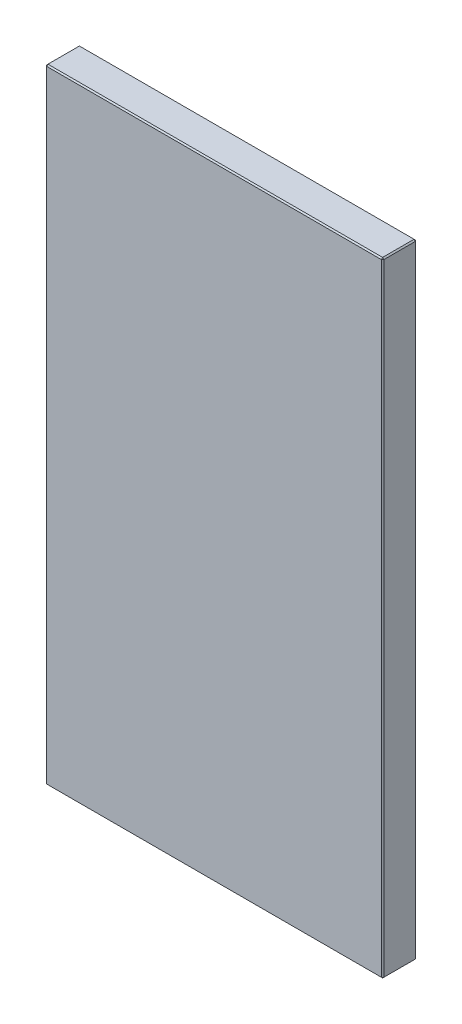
ISO-10303-21;
HEADER;
FILE_DESCRIPTION(('STEP AP214'),'2;1');
FILE_NAME('part.step','',(''),(''),'','','');
FILE_SCHEMA(('AUTOMOTIVE_DESIGN { 1 0 10303 214 1 1 1 1 }'));
ENDSEC;
DATA;
#1=APPLICATION_CONTEXT('core data for automotive mechanical design processes');
#2=APPLICATION_PROTOCOL_DEFINITION('international standard','automotive_design',2000,#1);
#3=PRODUCT_CONTEXT('',#1,'mechanical');
#4=PRODUCT('Part','Part','',(#3));
#5=PRODUCT_RELATED_PRODUCT_CATEGORY('part','',(#4));
#6=PRODUCT_DEFINITION_FORMATION('','',#4);
#7=PRODUCT_DEFINITION_CONTEXT('part definition',#1,'design');
#8=PRODUCT_DEFINITION('design','',#6,#7);
#9=PRODUCT_DEFINITION_SHAPE('','',#8);
#10=(LENGTH_UNIT() NAMED_UNIT(*) SI_UNIT(.MILLI.,.METRE.));
#11=(NAMED_UNIT(*) PLANE_ANGLE_UNIT() SI_UNIT($,.RADIAN.));
#12=(NAMED_UNIT(*) SI_UNIT($,.STERADIAN.) SOLID_ANGLE_UNIT());
#13=UNCERTAINTY_MEASURE_WITH_UNIT(LENGTH_MEASURE(1.E-05),#10,'distance_accuracy_value','');
#14=(GEOMETRIC_REPRESENTATION_CONTEXT(3) GLOBAL_UNCERTAINTY_ASSIGNED_CONTEXT((#13)) GLOBAL_UNIT_ASSIGNED_CONTEXT((#10,
#11,#12)) REPRESENTATION_CONTEXT('',''));
#15=CARTESIAN_POINT('',(0.,0.,0.));
#16=DIRECTION('',(0.,0.,1.));
#17=DIRECTION('',(1.,0.,0.));
#18=AXIS2_PLACEMENT_3D('',#15,#16,#17);
#19=CARTESIAN_POINT('',(-134.,-248.,27.));
#20=DIRECTION('',(1.,0.,0.));
#21=DIRECTION('',(0.,0.,-1.));
#22=AXIS2_PLACEMENT_3D('',#19,#20,#21);
#23=PLANE('',#22);
#24=DIRECTION('',(0.,0.,-1.));
#25=VECTOR('',#24,1.);
#26=CARTESIAN_POINT('',(-134.,247.,27.));
#27=LINE('',#26,#25);
#28=CARTESIAN_POINT('',(-134.,247.,26.));
#29=VERTEX_POINT('',#28);
#30=CARTESIAN_POINT('',(-134.,247.,1.));
#31=VERTEX_POINT('',#30);
#32=EDGE_CURVE('E114',#29,#31,#27,.T.);
#33=ORIENTED_EDGE('',*,*,#32,.T.);
#34=DIRECTION('',(0.,-1.,0.));
#35=VECTOR('',#34,1.);
#36=CARTESIAN_POINT('',(-134.,-248.,1.));
#37=LINE('',#36,#35);
#38=CARTESIAN_POINT('',(-134.,-247.,1.));
#39=VERTEX_POINT('',#38);
#40=EDGE_CURVE('E110',#31,#39,#37,.T.);
#41=ORIENTED_EDGE('',*,*,#40,.T.);
#42=DIRECTION('',(0.,0.,1.));
#43=VECTOR('',#42,1.);
#44=CARTESIAN_POINT('',(-134.,-247.,27.));
#45=LINE('',#44,#43);
#46=CARTESIAN_POINT('',(-134.,-247.,26.));
#47=VERTEX_POINT('',#46);
#48=EDGE_CURVE('E103',#39,#47,#45,.T.);
#49=ORIENTED_EDGE('',*,*,#48,.T.);
#50=DIRECTION('',(0.,1.,0.));
#51=VECTOR('',#50,1.);
#52=CARTESIAN_POINT('',(-134.,248.,26.));
#53=LINE('',#52,#51);
#54=EDGE_CURVE('E107',#47,#29,#53,.T.);
#55=ORIENTED_EDGE('',*,*,#54,.T.);
#56=EDGE_LOOP('',(#33,#41,#49,#55));
#57=FACE_BOUND('',#56,.T.);
#58=ADVANCED_FACE('F15',(#57),#23,.F.);
#59=CARTESIAN_POINT('',(134.,-248.,27.));
#60=DIRECTION('',(0.,1.,0.));
#61=DIRECTION('',(-1.,0.,0.));
#62=AXIS2_PLACEMENT_3D('',#59,#60,#61);
#63=PLANE('',#62);
#64=DIRECTION('',(0.,0.,-1.));
#65=VECTOR('',#64,1.);
#66=CARTESIAN_POINT('',(-133.,-248.,27.));
#67=LINE('',#66,#65);
#68=CARTESIAN_POINT('',(-133.,-248.,26.));
#69=VERTEX_POINT('',#68);
#70=CARTESIAN_POINT('',(-133.,-248.,1.));
#71=VERTEX_POINT('',#70);
#72=EDGE_CURVE('E122',#69,#71,#67,.T.);
#73=ORIENTED_EDGE('',*,*,#72,.T.);
#74=DIRECTION('',(1.,0.,0.));
#75=VECTOR('',#74,1.);
#76=CARTESIAN_POINT('',(134.,-248.,1.));
#77=LINE('',#76,#75);
#78=CARTESIAN_POINT('',(133.,-248.,1.));
#79=VERTEX_POINT('',#78);
#80=EDGE_CURVE('E160',#71,#79,#77,.T.);
#81=ORIENTED_EDGE('',*,*,#80,.T.);
#82=DIRECTION('',(0.,0.,1.));
#83=VECTOR('',#82,1.);
#84=CARTESIAN_POINT('',(133.,-248.,27.));
#85=LINE('',#84,#83);
#86=CARTESIAN_POINT('',(133.,-248.,26.));
#87=VERTEX_POINT('',#86);
#88=EDGE_CURVE('E157',#79,#87,#85,.T.);
#89=ORIENTED_EDGE('',*,*,#88,.T.);
#90=DIRECTION('',(-1.,0.,0.));
#91=VECTOR('',#90,1.);
#92=CARTESIAN_POINT('',(-134.,-248.,26.));
#93=LINE('',#92,#91);
#94=EDGE_CURVE('E155',#87,#69,#93,.T.);
#95=ORIENTED_EDGE('',*,*,#94,.T.);
#96=EDGE_LOOP('',(#73,#81,#89,#95));
#97=FACE_BOUND('',#96,.T.);
#98=ADVANCED_FACE('F277',(#97),#63,.F.);
#99=CARTESIAN_POINT('',(134.,-248.,27.));
#100=DIRECTION('',(-1.,0.,0.));
#101=DIRECTION('',(0.,0.,1.));
#102=AXIS2_PLACEMENT_3D('',#99,#100,#101);
#103=PLANE('',#102);
#104=DIRECTION('',(0.,-1.,0.));
#105=VECTOR('',#104,1.);
#106=CARTESIAN_POINT('',(134.,-248.,26.));
#107=LINE('',#106,#105);
#108=CARTESIAN_POINT('',(134.,247.,26.));
#109=VERTEX_POINT('',#108);
#110=CARTESIAN_POINT('',(134.,-247.,26.));
#111=VERTEX_POINT('',#110);
#112=EDGE_CURVE('E162',#109,#111,#107,.T.);
#113=ORIENTED_EDGE('',*,*,#112,.T.);
#114=DIRECTION('',(0.,0.,-1.));
#115=VECTOR('',#114,1.);
#116=CARTESIAN_POINT('',(134.,-247.,27.));
#117=LINE('',#116,#115);
#118=CARTESIAN_POINT('',(134.,-247.,1.));
#119=VERTEX_POINT('',#118);
#120=EDGE_CURVE('E168',#111,#119,#117,.T.);
#121=ORIENTED_EDGE('',*,*,#120,.T.);
#122=DIRECTION('',(0.,1.,0.));
#123=VECTOR('',#122,1.);
#124=CARTESIAN_POINT('',(134.,-248.,1.));
#125=LINE('',#124,#123);
#126=CARTESIAN_POINT('',(134.,247.,1.));
#127=VERTEX_POINT('',#126);
#128=EDGE_CURVE('E166',#119,#127,#125,.T.);
#129=ORIENTED_EDGE('',*,*,#128,.T.);
#130=DIRECTION('',(0.,0.,1.));
#131=VECTOR('',#130,1.);
#132=CARTESIAN_POINT('',(134.,247.,27.));
#133=LINE('',#132,#131);
#134=EDGE_CURVE('E164',#127,#109,#133,.T.);
#135=ORIENTED_EDGE('',*,*,#134,.T.);
#136=EDGE_LOOP('',(#113,#121,#129,#135));
#137=FACE_BOUND('',#136,.T.);
#138=ADVANCED_FACE('F254',(#137),#103,.F.);
#139=CARTESIAN_POINT('',(134.,248.,27.));
#140=DIRECTION('',(0.,-1.,0.));
#141=DIRECTION('',(1.,0.,0.));
#142=AXIS2_PLACEMENT_3D('',#139,#140,#141);
#143=PLANE('',#142);
#144=DIRECTION('',(-1.,0.,0.));
#145=VECTOR('',#144,1.);
#146=CARTESIAN_POINT('',(134.,248.,1.));
#147=LINE('',#146,#145);
#148=CARTESIAN_POINT('',(133.,248.,1.));
#149=VERTEX_POINT('',#148);
#150=CARTESIAN_POINT('',(-133.,248.,1.));
#151=VERTEX_POINT('',#150);
#152=EDGE_CURVE('E150',#149,#151,#147,.T.);
#153=ORIENTED_EDGE('',*,*,#152,.T.);
#154=DIRECTION('',(0.,0.,1.));
#155=VECTOR('',#154,1.);
#156=CARTESIAN_POINT('',(-133.,248.,27.));
#157=LINE('',#156,#155);
#158=CARTESIAN_POINT('',(-133.,248.,26.));
#159=VERTEX_POINT('',#158);
#160=EDGE_CURVE('E152',#151,#159,#157,.T.);
#161=ORIENTED_EDGE('',*,*,#160,.T.);
#162=DIRECTION('',(1.,0.,0.));
#163=VECTOR('',#162,1.);
#164=CARTESIAN_POINT('',(134.,248.,26.));
#165=LINE('',#164,#163);
#166=CARTESIAN_POINT('',(133.,248.,26.));
#167=VERTEX_POINT('',#166);
#168=EDGE_CURVE('E146',#159,#167,#165,.T.);
#169=ORIENTED_EDGE('',*,*,#168,.T.);
#170=DIRECTION('',(0.,0.,-1.));
#171=VECTOR('',#170,1.);
#172=CARTESIAN_POINT('',(133.,248.,27.));
#173=LINE('',#172,#171);
#174=EDGE_CURVE('E148',#167,#149,#173,.T.);
#175=ORIENTED_EDGE('',*,*,#174,.T.);
#176=EDGE_LOOP('',(#153,#161,#169,#175));
#177=FACE_BOUND('',#176,.T.);
#178=ADVANCED_FACE('F286',(#177),#143,.F.);
#179=CARTESIAN_POINT('',(0.,0.,27.));
#180=DIRECTION('',(0.,0.,1.));
#181=DIRECTION('',(1.,0.,0.));
#182=AXIS2_PLACEMENT_3D('',#179,#180,#181);
#183=PLANE('',#182);
#184=DIRECTION('',(0.,1.,0.));
#185=VECTOR('',#184,1.);
#186=CARTESIAN_POINT('',(133.,248.,27.));
#187=LINE('',#186,#185);
#188=CARTESIAN_POINT('',(133.,-247.,27.));
#189=VERTEX_POINT('',#188);
#190=CARTESIAN_POINT('',(133.,247.,27.));
#191=VERTEX_POINT('',#190);
#192=EDGE_CURVE('E24',#189,#191,#187,.T.);
#193=ORIENTED_EDGE('',*,*,#192,.T.);
#194=DIRECTION('',(-1.,0.,0.));
#195=VECTOR('',#194,1.);
#196=CARTESIAN_POINT('',(-134.,247.,27.));
#197=LINE('',#196,#195);
#198=CARTESIAN_POINT('',(-133.,247.,27.));
#199=VERTEX_POINT('',#198);
#200=EDGE_CURVE('E9',#191,#199,#197,.T.);
#201=ORIENTED_EDGE('',*,*,#200,.T.);
#202=DIRECTION('',(0.,-1.,0.));
#203=VECTOR('',#202,1.);
#204=CARTESIAN_POINT('',(-133.,-248.,27.));
#205=LINE('',#204,#203);
#206=CARTESIAN_POINT('',(-133.,-247.,27.));
#207=VERTEX_POINT('',#206);
#208=EDGE_CURVE('E180',#199,#207,#205,.T.);
#209=ORIENTED_EDGE('',*,*,#208,.T.);
#210=DIRECTION('',(1.,0.,0.));
#211=VECTOR('',#210,1.);
#212=CARTESIAN_POINT('',(134.,-247.,27.));
#213=LINE('',#212,#211);
#214=EDGE_CURVE('E35',#207,#189,#213,.T.);
#215=ORIENTED_EDGE('',*,*,#214,.T.);
#216=EDGE_LOOP('',(#193,#201,#209,#215));
#217=FACE_BOUND('',#216,.T.);
#218=ADVANCED_FACE('F351',(#217),#183,.T.);
#219=CARTESIAN_POINT('',(0.,0.,0.));
#220=DIRECTION('',(0.,0.,1.));
#221=DIRECTION('',(1.,0.,0.));
#222=AXIS2_PLACEMENT_3D('',#219,#220,#221);
#223=PLANE('',#222);
#224=DIRECTION('',(0.,-1.,0.));
#225=VECTOR('',#224,1.);
#226=CARTESIAN_POINT('',(133.,0.,0.));
#227=LINE('',#226,#225);
#228=CARTESIAN_POINT('',(133.,247.,0.));
#229=VERTEX_POINT('',#228);
#230=CARTESIAN_POINT('',(133.,-247.,0.));
#231=VERTEX_POINT('',#230);
#232=EDGE_CURVE('E175',#229,#231,#227,.T.);
#233=ORIENTED_EDGE('',*,*,#232,.T.);
#234=DIRECTION('',(-1.,0.,0.));
#235=VECTOR('',#234,1.);
#236=CARTESIAN_POINT('',(0.,-247.,0.));
#237=LINE('',#236,#235);
#238=CARTESIAN_POINT('',(-133.,-247.,0.));
#239=VERTEX_POINT('',#238);
#240=EDGE_CURVE('E177',#231,#239,#237,.T.);
#241=ORIENTED_EDGE('',*,*,#240,.T.);
#242=DIRECTION('',(0.,1.,0.));
#243=VECTOR('',#242,1.);
#244=CARTESIAN_POINT('',(-133.,0.,0.));
#245=LINE('',#244,#243);
#246=CARTESIAN_POINT('',(-133.,247.,0.));
#247=VERTEX_POINT('',#246);
#248=EDGE_CURVE('E173',#239,#247,#245,.T.);
#249=ORIENTED_EDGE('',*,*,#248,.T.);
#250=DIRECTION('',(1.,0.,0.));
#251=VECTOR('',#250,1.);
#252=CARTESIAN_POINT('',(0.,247.,0.));
#253=LINE('',#252,#251);
#254=EDGE_CURVE('E171',#247,#229,#253,.T.);
#255=ORIENTED_EDGE('',*,*,#254,.T.);
#256=EDGE_LOOP('',(#233,#241,#249,#255));
#257=FACE_BOUND('',#256,.T.);
#258=ADVANCED_FACE('F246',(#257),#223,.F.);
#259=CARTESIAN_POINT('',(134.,-247.,27.));
#260=DIRECTION('',(-0.707106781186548,0.707106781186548,0.));
#261=DIRECTION('',(0.,0.,-1.));
#262=AXIS2_PLACEMENT_3D('',#259,#260,#261);
#263=PLANE('',#262);
#264=DIRECTION('',(-0.707106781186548,-0.707106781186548,0.));
#265=VECTOR('',#264,1.);
#266=CARTESIAN_POINT('',(133.,-248.,26.));
#267=LINE('',#266,#265);
#268=EDGE_CURVE('E19',#87,#111,#267,.F.);
#269=ORIENTED_EDGE('',*,*,#268,.F.);
#270=ORIENTED_EDGE('',*,*,#88,.F.);
#271=DIRECTION('',(0.707106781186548,0.707106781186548,0.));
#272=VECTOR('',#271,1.);
#273=CARTESIAN_POINT('',(134.,-247.,1.));
#274=LINE('',#273,#272);
#275=EDGE_CURVE('E142',#119,#79,#274,.F.);
#276=ORIENTED_EDGE('',*,*,#275,.F.);
#277=ORIENTED_EDGE('',*,*,#120,.F.);
#278=EDGE_LOOP('',(#269,#270,#276,#277));
#279=FACE_BOUND('',#278,.T.);
#280=ADVANCED_FACE('F17',(#279),#263,.F.);
#281=CARTESIAN_POINT('',(133.,-248.,26.));
#282=DIRECTION('',(0.577350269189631,-0.577350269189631,0.577350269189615));
#283=DIRECTION('',(0.707106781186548,0.707106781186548,0.));
#284=AXIS2_PLACEMENT_3D('',#281,#282,#283);
#285=PLANE('',#284);
#286=DIRECTION('',(0.,-0.707106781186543,-0.707106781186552));
#287=VECTOR('',#286,1.);
#288=CARTESIAN_POINT('',(133.,-248.,26.));
#289=LINE('',#288,#287);
#290=EDGE_CURVE('E227',#87,#189,#289,.F.);
#291=ORIENTED_EDGE('',*,*,#290,.F.);
#292=ORIENTED_EDGE('',*,*,#268,.T.);
#293=DIRECTION('',(-0.707106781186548,0.,0.707106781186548));
#294=VECTOR('',#293,1.);
#295=CARTESIAN_POINT('',(133.5,-247.,26.5));
#296=LINE('',#295,#294);
#297=EDGE_CURVE('E229',#189,#111,#296,.F.);
#298=ORIENTED_EDGE('',*,*,#297,.F.);
#299=EDGE_LOOP('',(#291,#292,#298));
#300=FACE_BOUND('',#299,.T.);
#301=ADVANCED_FACE('F272',(#300),#285,.T.);
#302=CARTESIAN_POINT('',(134.,-247.,1.));
#303=DIRECTION('',(0.577350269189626,-0.577350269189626,-0.577350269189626));
#304=DIRECTION('',(-0.707106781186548,0.,-0.707106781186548));
#305=AXIS2_PLACEMENT_3D('',#302,#303,#304);
#306=PLANE('',#305);
#307=DIRECTION('',(-0.707106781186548,0.,-0.707106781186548));
#308=VECTOR('',#307,1.);
#309=CARTESIAN_POINT('',(134.,-247.,1.));
#310=LINE('',#309,#308);
#311=EDGE_CURVE('E221',#119,#231,#310,.T.);
#312=ORIENTED_EDGE('',*,*,#311,.F.);
#313=ORIENTED_EDGE('',*,*,#275,.T.);
#314=DIRECTION('',(0.,-0.707106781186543,0.707106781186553));
#315=VECTOR('',#314,1.);
#316=CARTESIAN_POINT('',(133.,-247.5,0.500000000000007));
#317=LINE('',#316,#315);
#318=EDGE_CURVE('E224',#231,#79,#317,.T.);
#319=ORIENTED_EDGE('',*,*,#318,.F.);
#320=EDGE_LOOP('',(#312,#313,#319));
#321=FACE_BOUND('',#320,.T.);
#322=ADVANCED_FACE('F236',(#321),#306,.T.);
#323=CARTESIAN_POINT('',(133.,0.,27.));
#324=DIRECTION('',(0.707106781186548,0.,0.707106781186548));
#325=DIRECTION('',(0.,-1.,0.));
#326=AXIS2_PLACEMENT_3D('',#323,#324,#325);
#327=PLANE('',#326);
#328=ORIENTED_EDGE('',*,*,#297,.T.);
#329=ORIENTED_EDGE('',*,*,#112,.F.);
#330=DIRECTION('',(0.707106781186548,0.,-0.707106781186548));
#331=VECTOR('',#330,1.);
#332=CARTESIAN_POINT('',(134.,247.,26.));
#333=LINE('',#332,#331);
#334=EDGE_CURVE('E215',#191,#109,#333,.T.);
#335=ORIENTED_EDGE('',*,*,#334,.F.);
#336=ORIENTED_EDGE('',*,*,#192,.F.);
#337=EDGE_LOOP('',(#328,#329,#335,#336));
#338=FACE_BOUND('',#337,.T.);
#339=ADVANCED_FACE('F267',(#338),#327,.T.);
#340=CARTESIAN_POINT('',(0.,-247.,27.));
#341=DIRECTION('',(0.,-0.707106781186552,0.707106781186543));
#342=DIRECTION('',(-1.,0.,0.));
#343=AXIS2_PLACEMENT_3D('',#340,#341,#342);
#344=PLANE('',#343);
#345=ORIENTED_EDGE('',*,*,#290,.T.);
#346=ORIENTED_EDGE('',*,*,#214,.F.);
#347=DIRECTION('',(0.,0.707106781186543,0.707106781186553));
#348=VECTOR('',#347,1.);
#349=CARTESIAN_POINT('',(-133.,-247.5,26.5));
#350=LINE('',#349,#348);
#351=EDGE_CURVE('E126',#69,#207,#350,.T.);
#352=ORIENTED_EDGE('',*,*,#351,.F.);
#353=ORIENTED_EDGE('',*,*,#94,.F.);
#354=EDGE_LOOP('',(#345,#346,#352,#353));
#355=FACE_BOUND('',#354,.T.);
#356=ADVANCED_FACE('F275',(#355),#344,.T.);
#357=CARTESIAN_POINT('',(-133.,-248.,27.));
#358=DIRECTION('',(0.707106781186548,0.707106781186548,0.));
#359=DIRECTION('',(0.,0.,-1.));
#360=AXIS2_PLACEMENT_3D('',#357,#358,#359);
#361=PLANE('',#360);
#362=DIRECTION('',(0.707106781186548,-0.707106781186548,0.));
#363=VECTOR('',#362,1.);
#364=CARTESIAN_POINT('',(-133.,-248.,1.));
#365=LINE('',#364,#363);
#366=EDGE_CURVE('E127',#71,#39,#365,.F.);
#367=ORIENTED_EDGE('',*,*,#366,.F.);
#368=ORIENTED_EDGE('',*,*,#72,.F.);
#369=DIRECTION('',(-0.707106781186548,0.707106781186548,0.));
#370=VECTOR('',#369,1.);
#371=CARTESIAN_POINT('',(-134.,-247.,26.));
#372=LINE('',#371,#370);
#373=EDGE_CURVE('E118',#47,#69,#372,.F.);
#374=ORIENTED_EDGE('',*,*,#373,.F.);
#375=ORIENTED_EDGE('',*,*,#48,.F.);
#376=EDGE_LOOP('',(#367,#368,#374,#375));
#377=FACE_BOUND('',#376,.T.);
#378=ADVANCED_FACE('F120',(#377),#361,.F.);
#379=CARTESIAN_POINT('',(134.,-248.,1.));
#380=DIRECTION('',(0.,0.707106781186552,0.707106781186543));
#381=DIRECTION('',(1.,0.,0.));
#382=AXIS2_PLACEMENT_3D('',#379,#380,#381);
#383=PLANE('',#382);
#384=ORIENTED_EDGE('',*,*,#318,.T.);
#385=ORIENTED_EDGE('',*,*,#80,.F.);
#386=DIRECTION('',(0.,0.707106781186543,-0.707106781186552));
#387=VECTOR('',#386,1.);
#388=CARTESIAN_POINT('',(-133.,-248.,1.));
#389=LINE('',#388,#387);
#390=EDGE_CURVE('E211',#239,#71,#389,.F.);
#391=ORIENTED_EDGE('',*,*,#390,.F.);
#392=ORIENTED_EDGE('',*,*,#240,.F.);
#393=EDGE_LOOP('',(#384,#385,#391,#392));
#394=FACE_BOUND('',#393,.T.);
#395=ADVANCED_FACE('F243',(#394),#383,.F.);
#396=CARTESIAN_POINT('',(134.,-248.,1.));
#397=DIRECTION('',(-0.707106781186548,0.,0.707106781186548));
#398=DIRECTION('',(0.,1.,0.));
#399=AXIS2_PLACEMENT_3D('',#396,#397,#398);
#400=PLANE('',#399);
#401=ORIENTED_EDGE('',*,*,#311,.T.);
#402=ORIENTED_EDGE('',*,*,#232,.F.);
#403=DIRECTION('',(0.707106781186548,0.,0.707106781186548));
#404=VECTOR('',#403,1.);
#405=CARTESIAN_POINT('',(134.,247.,1.));
#406=LINE('',#405,#404);
#407=EDGE_CURVE('E208',#127,#229,#406,.F.);
#408=ORIENTED_EDGE('',*,*,#407,.F.);
#409=ORIENTED_EDGE('',*,*,#128,.F.);
#410=EDGE_LOOP('',(#401,#402,#408,#409));
#411=FACE_BOUND('',#410,.T.);
#412=ADVANCED_FACE('F251',(#411),#400,.F.);
#413=CARTESIAN_POINT('',(133.,248.,27.));
#414=DIRECTION('',(-0.707106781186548,-0.707106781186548,0.));
#415=DIRECTION('',(0.,0.,-1.));
#416=AXIS2_PLACEMENT_3D('',#413,#414,#415);
#417=PLANE('',#416);
#418=DIRECTION('',(0.707106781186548,-0.707106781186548,0.));
#419=VECTOR('',#418,1.);
#420=CARTESIAN_POINT('',(134.,247.,26.));
#421=LINE('',#420,#419);
#422=EDGE_CURVE('E218',#109,#167,#421,.F.);
#423=ORIENTED_EDGE('',*,*,#422,.F.);
#424=ORIENTED_EDGE('',*,*,#134,.F.);
#425=DIRECTION('',(-0.707106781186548,0.707106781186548,0.));
#426=VECTOR('',#425,1.);
#427=CARTESIAN_POINT('',(134.,247.,1.));
#428=LINE('',#427,#426);
#429=EDGE_CURVE('E205',#149,#127,#428,.F.);
#430=ORIENTED_EDGE('',*,*,#429,.F.);
#431=ORIENTED_EDGE('',*,*,#174,.F.);
#432=EDGE_LOOP('',(#423,#424,#430,#431));
#433=FACE_BOUND('',#432,.T.);
#434=ADVANCED_FACE('F259',(#433),#417,.F.);
#435=CARTESIAN_POINT('',(134.,247.,26.));
#436=DIRECTION('',(0.577350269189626,0.577350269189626,0.577350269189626));
#437=DIRECTION('',(0.707106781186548,0.,-0.707106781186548));
#438=AXIS2_PLACEMENT_3D('',#435,#436,#437);
#439=PLANE('',#438);
#440=ORIENTED_EDGE('',*,*,#334,.T.);
#441=ORIENTED_EDGE('',*,*,#422,.T.);
#442=DIRECTION('',(0.,-0.707106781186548,0.707106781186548));
#443=VECTOR('',#442,1.);
#444=CARTESIAN_POINT('',(133.,247.5,26.5));
#445=LINE('',#444,#443);
#446=EDGE_CURVE('E134',#191,#167,#445,.F.);
#447=ORIENTED_EDGE('',*,*,#446,.F.);
#448=EDGE_LOOP('',(#440,#441,#447));
#449=FACE_BOUND('',#448,.T.);
#450=ADVANCED_FACE('F264',(#449),#439,.T.);
#451=CARTESIAN_POINT('',(-134.,-247.,26.));
#452=DIRECTION('',(-0.577350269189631,-0.577350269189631,0.577350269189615));
#453=DIRECTION('',(0.707106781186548,-0.707106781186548,0.));
#454=AXIS2_PLACEMENT_3D('',#451,#452,#453);
#455=PLANE('',#454);
#456=ORIENTED_EDGE('',*,*,#373,.T.);
#457=ORIENTED_EDGE('',*,*,#351,.T.);
#458=DIRECTION('',(-0.707106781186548,0.,-0.707106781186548));
#459=VECTOR('',#458,1.);
#460=CARTESIAN_POINT('',(-134.,-247.,26.));
#461=LINE('',#460,#459);
#462=EDGE_CURVE('E130',#47,#207,#461,.F.);
#463=ORIENTED_EDGE('',*,*,#462,.F.);
#464=EDGE_LOOP('',(#456,#457,#463));
#465=FACE_BOUND('',#464,.T.);
#466=ADVANCED_FACE('F131',(#465),#455,.T.);
#467=CARTESIAN_POINT('',(-133.,-248.,1.));
#468=DIRECTION('',(-0.577350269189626,-0.577350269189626,-0.577350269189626));
#469=DIRECTION('',(-0.707106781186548,0.,0.707106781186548));
#470=AXIS2_PLACEMENT_3D('',#467,#468,#469);
#471=PLANE('',#470);
#472=ORIENTED_EDGE('',*,*,#390,.T.);
#473=ORIENTED_EDGE('',*,*,#366,.T.);
#474=DIRECTION('',(-0.707106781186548,0.,0.707106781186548));
#475=VECTOR('',#474,1.);
#476=CARTESIAN_POINT('',(-133.5,-247.,0.5));
#477=LINE('',#476,#475);
#478=EDGE_CURVE('E135',#239,#39,#477,.T.);
#479=ORIENTED_EDGE('',*,*,#478,.F.);
#480=EDGE_LOOP('',(#472,#473,#479));
#481=FACE_BOUND('',#480,.T.);
#482=ADVANCED_FACE('F320',(#481),#471,.T.);
#483=CARTESIAN_POINT('',(134.,247.,1.));
#484=DIRECTION('',(0.577350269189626,0.577350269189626,-0.577350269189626));
#485=DIRECTION('',(-0.707106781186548,0.,-0.707106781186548));
#486=AXIS2_PLACEMENT_3D('',#483,#484,#485);
#487=PLANE('',#486);
#488=ORIENTED_EDGE('',*,*,#429,.T.);
#489=ORIENTED_EDGE('',*,*,#407,.T.);
#490=DIRECTION('',(0.,-0.707106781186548,-0.707106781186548));
#491=VECTOR('',#490,1.);
#492=CARTESIAN_POINT('',(133.,247.5,0.5));
#493=LINE('',#492,#491);
#494=EDGE_CURVE('E198',#149,#229,#493,.T.);
#495=ORIENTED_EDGE('',*,*,#494,.F.);
#496=EDGE_LOOP('',(#488,#489,#495));
#497=FACE_BOUND('',#496,.T.);
#498=ADVANCED_FACE('F316',(#497),#487,.T.);
#499=CARTESIAN_POINT('',(0.,247.,27.));
#500=DIRECTION('',(0.,0.707106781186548,0.707106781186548));
#501=DIRECTION('',(1.,0.,0.));
#502=AXIS2_PLACEMENT_3D('',#499,#500,#501);
#503=PLANE('',#502);
#504=ORIENTED_EDGE('',*,*,#446,.T.);
#505=ORIENTED_EDGE('',*,*,#168,.F.);
#506=DIRECTION('',(0.,0.707106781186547,-0.707106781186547));
#507=VECTOR('',#506,1.);
#508=CARTESIAN_POINT('',(-133.,248.,26.));
#509=LINE('',#508,#507);
#510=EDGE_CURVE('E195',#199,#159,#509,.T.);
#511=ORIENTED_EDGE('',*,*,#510,.F.);
#512=ORIENTED_EDGE('',*,*,#200,.F.);
#513=EDGE_LOOP('',(#504,#505,#511,#512));
#514=FACE_BOUND('',#513,.T.);
#515=ADVANCED_FACE('F313',(#514),#503,.T.);
#516=CARTESIAN_POINT('',(-133.,0.,27.));
#517=DIRECTION('',(-0.707106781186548,0.,0.707106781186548));
#518=DIRECTION('',(0.,1.,0.));
#519=AXIS2_PLACEMENT_3D('',#516,#517,#518);
#520=PLANE('',#519);
#521=ORIENTED_EDGE('',*,*,#462,.T.);
#522=ORIENTED_EDGE('',*,*,#208,.F.);
#523=DIRECTION('',(0.707106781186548,0.,0.707106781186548));
#524=VECTOR('',#523,1.);
#525=CARTESIAN_POINT('',(-133.5,247.,26.5));
#526=LINE('',#525,#524);
#527=EDGE_CURVE('E138',#29,#199,#526,.T.);
#528=ORIENTED_EDGE('',*,*,#527,.F.);
#529=ORIENTED_EDGE('',*,*,#54,.F.);
#530=EDGE_LOOP('',(#521,#522,#528,#529));
#531=FACE_BOUND('',#530,.T.);
#532=ADVANCED_FACE('F137',(#531),#520,.T.);
#533=CARTESIAN_POINT('',(-134.,-248.,1.));
#534=DIRECTION('',(0.707106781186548,0.,0.707106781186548));
#535=DIRECTION('',(0.,-1.,0.));
#536=AXIS2_PLACEMENT_3D('',#533,#534,#535);
#537=PLANE('',#536);
#538=ORIENTED_EDGE('',*,*,#478,.T.);
#539=ORIENTED_EDGE('',*,*,#40,.F.);
#540=DIRECTION('',(0.707106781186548,0.,-0.707106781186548));
#541=VECTOR('',#540,1.);
#542=CARTESIAN_POINT('',(-134.,247.,1.));
#543=LINE('',#542,#541);
#544=EDGE_CURVE('E191',#247,#31,#543,.F.);
#545=ORIENTED_EDGE('',*,*,#544,.F.);
#546=ORIENTED_EDGE('',*,*,#248,.F.);
#547=EDGE_LOOP('',(#538,#539,#545,#546));
#548=FACE_BOUND('',#547,.T.);
#549=ADVANCED_FACE('F306',(#548),#537,.F.);
#550=CARTESIAN_POINT('',(134.,248.,1.));
#551=DIRECTION('',(0.,-0.707106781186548,0.707106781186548));
#552=DIRECTION('',(-1.,0.,0.));
#553=AXIS2_PLACEMENT_3D('',#550,#551,#552);
#554=PLANE('',#553);
#555=ORIENTED_EDGE('',*,*,#494,.T.);
#556=ORIENTED_EDGE('',*,*,#254,.F.);
#557=DIRECTION('',(0.,0.707106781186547,0.707106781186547));
#558=VECTOR('',#557,1.);
#559=CARTESIAN_POINT('',(-133.,247.5,0.499999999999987));
#560=LINE('',#559,#558);
#561=EDGE_CURVE('E188',#151,#247,#560,.F.);
#562=ORIENTED_EDGE('',*,*,#561,.F.);
#563=ORIENTED_EDGE('',*,*,#152,.F.);
#564=EDGE_LOOP('',(#555,#556,#562,#563));
#565=FACE_BOUND('',#564,.T.);
#566=ADVANCED_FACE('F302',(#565),#554,.F.);
#567=CARTESIAN_POINT('',(-133.,248.,26.));
#568=DIRECTION('',(-0.577350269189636,0.57735026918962,0.57735026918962));
#569=DIRECTION('',(0.707106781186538,0.,0.707106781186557));
#570=AXIS2_PLACEMENT_3D('',#567,#568,#569);
#571=PLANE('',#570);
#572=ORIENTED_EDGE('',*,*,#527,.T.);
#573=ORIENTED_EDGE('',*,*,#510,.T.);
#574=DIRECTION('',(0.707106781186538,0.707106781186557,0.));
#575=VECTOR('',#574,1.);
#576=CARTESIAN_POINT('',(-133.,248.,26.));
#577=LINE('',#576,#575);
#578=EDGE_CURVE('E186',#29,#159,#577,.T.);
#579=ORIENTED_EDGE('',*,*,#578,.F.);
#580=EDGE_LOOP('',(#572,#573,#579));
#581=FACE_BOUND('',#580,.T.);
#582=ADVANCED_FACE('F298',(#581),#571,.T.);
#583=CARTESIAN_POINT('',(-134.,247.,1.));
#584=DIRECTION('',(-0.577350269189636,0.57735026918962,-0.57735026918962));
#585=DIRECTION('',(-0.707106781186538,0.,0.707106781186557));
#586=AXIS2_PLACEMENT_3D('',#583,#584,#585);
#587=PLANE('',#586);
#588=ORIENTED_EDGE('',*,*,#561,.T.);
#589=ORIENTED_EDGE('',*,*,#544,.T.);
#590=DIRECTION('',(-0.707106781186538,-0.707106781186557,0.));
#591=VECTOR('',#590,1.);
#592=CARTESIAN_POINT('',(-134.,247.,1.));
#593=LINE('',#592,#591);
#594=EDGE_CURVE('E184',#151,#31,#593,.T.);
#595=ORIENTED_EDGE('',*,*,#594,.F.);
#596=EDGE_LOOP('',(#588,#589,#595));
#597=FACE_BOUND('',#596,.T.);
#598=ADVANCED_FACE('F294',(#597),#587,.T.);
#599=CARTESIAN_POINT('',(-134.,247.,27.));
#600=DIRECTION('',(0.707106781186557,-0.707106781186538,0.));
#601=DIRECTION('',(0.,0.,-1.));
#602=AXIS2_PLACEMENT_3D('',#599,#600,#601);
#603=PLANE('',#602);
#604=ORIENTED_EDGE('',*,*,#578,.T.);
#605=ORIENTED_EDGE('',*,*,#160,.F.);
#606=ORIENTED_EDGE('',*,*,#594,.T.);
#607=ORIENTED_EDGE('',*,*,#32,.F.);
#608=EDGE_LOOP('',(#604,#605,#606,#607));
#609=FACE_BOUND('',#608,.T.);
#610=ADVANCED_FACE('F291',(#609),#603,.F.);
#611=CLOSED_SHELL('',(#58,#98,#138,#178,#218,#258,#280,#301,#322,#339,#356,#378,#395,#412,#434,
#450,#466,#482,#498,#515,#532,#549,#566,#582,#598,#610));
#612=MANIFOLD_SOLID_BREP('B1',#611);
#613=ADVANCED_BREP_SHAPE_REPRESENTATION('',(#18,#612),#14);
#614=SHAPE_DEFINITION_REPRESENTATION(#9,#613);
ENDSEC;
END-ISO-10303-21;
